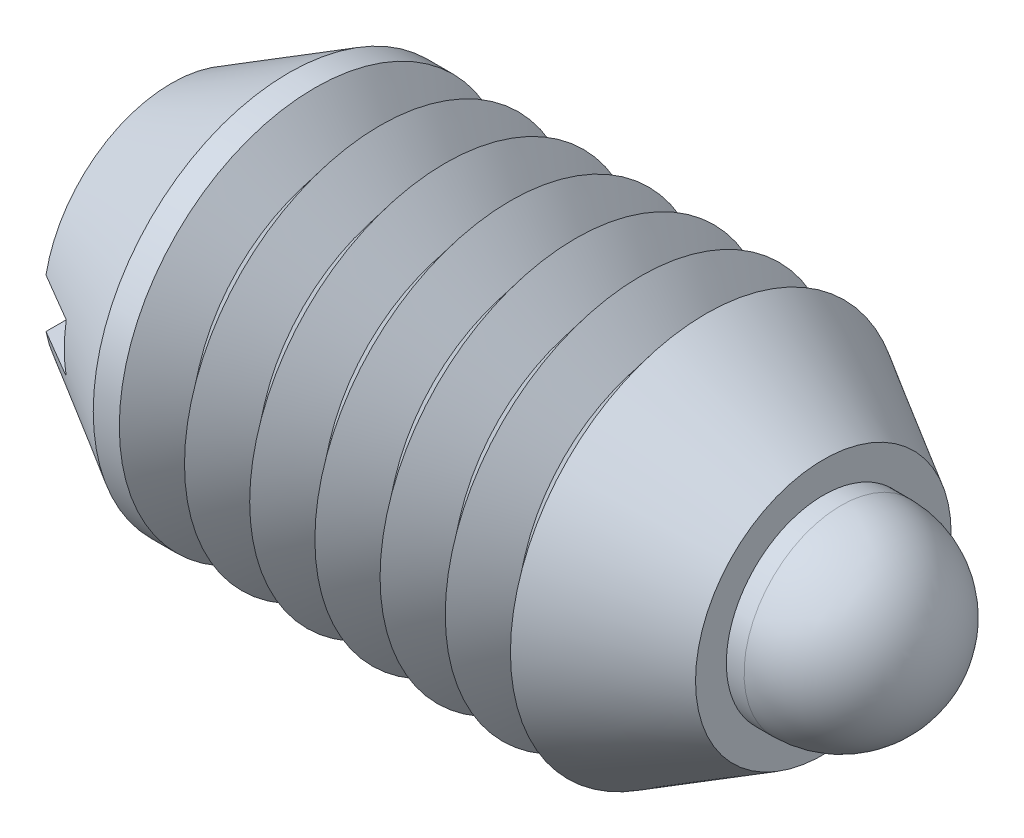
ISO-10303-21;
HEADER;
FILE_DESCRIPTION(('STEP AP214'),'2;1');
FILE_NAME('part.step','',(''),(''),'','','');
FILE_SCHEMA(('AUTOMOTIVE_DESIGN { 1 0 10303 214 1 1 1 1 }'));
ENDSEC;
DATA;
#1=APPLICATION_CONTEXT('core data for automotive mechanical design processes');
#2=APPLICATION_PROTOCOL_DEFINITION('international standard','automotive_design',2000,#1);
#3=PRODUCT_CONTEXT('',#1,'mechanical');
#4=PRODUCT('Part','Part','',(#3));
#5=PRODUCT_RELATED_PRODUCT_CATEGORY('part','',(#4));
#6=PRODUCT_DEFINITION_FORMATION('','',#4);
#7=PRODUCT_DEFINITION_CONTEXT('part definition',#1,'design');
#8=PRODUCT_DEFINITION('design','',#6,#7);
#9=PRODUCT_DEFINITION_SHAPE('','',#8);
#10=(LENGTH_UNIT() NAMED_UNIT(*) SI_UNIT(.MILLI.,.METRE.));
#11=(NAMED_UNIT(*) PLANE_ANGLE_UNIT() SI_UNIT($,.RADIAN.));
#12=(NAMED_UNIT(*) SI_UNIT($,.STERADIAN.) SOLID_ANGLE_UNIT());
#13=UNCERTAINTY_MEASURE_WITH_UNIT(LENGTH_MEASURE(1.E-05),#10,'distance_accuracy_value','');
#14=(GEOMETRIC_REPRESENTATION_CONTEXT(3) GLOBAL_UNCERTAINTY_ASSIGNED_CONTEXT((#13)) GLOBAL_UNIT_ASSIGNED_CONTEXT((#10,
#11,#12)) REPRESENTATION_CONTEXT('',''));
#15=CARTESIAN_POINT('',(0.,0.,0.));
#16=DIRECTION('',(0.,0.,1.));
#17=DIRECTION('',(1.,0.,0.));
#18=AXIS2_PLACEMENT_3D('',#15,#16,#17);
#19=CARTESIAN_POINT('',(10.44194,0.,0.));
#20=DIRECTION('',(-1.,0.,0.));
#21=DIRECTION('',(0.,-0.719424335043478,-0.694570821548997));
#22=AXIS2_PLACEMENT_3D('',#19,#20,#21);
#23=PLANE('',#22);
#24=CARTESIAN_POINT('',(10.44194,0.,0.));
#25=DIRECTION('',(1.,0.,0.));
#26=DIRECTION('',(0.,0.719424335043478,0.694570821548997));
#27=AXIS2_PLACEMENT_3D('',#24,#25,#26);
#28=CIRCLE('',#27,2.3622);
#29=CARTESIAN_POINT('',(10.44194,1.6994241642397,1.64071519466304));
#30=VERTEX_POINT('',#29);
#31=EDGE_CURVE('P0_E10',#30,#30,#28,.T.);
#32=ORIENTED_EDGE('',*,*,#31,.F.);
#33=EDGE_LOOP('',(#32));
#34=FACE_BOUND('',#33,.T.);
#35=ADVANCED_FACE('P0_F14',(#34),#23,.T.);
#36=CARTESIAN_POINT('',(10.91438,0.,0.));
#37=DIRECTION('',(1.,0.,0.));
#38=DIRECTION('',(0.,0.719424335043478,0.694570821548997));
#39=AXIS2_PLACEMENT_3D('',#36,#37,#38);
#40=CONICAL_SURFACE('',#39,2.83464,0.785398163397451);
#41=ORIENTED_EDGE('',*,*,#31,.T.);
#42=EDGE_LOOP('',(#41));
#43=FACE_BOUND('',#42,.T.);
#44=CARTESIAN_POINT('',(10.91438,0.,0.));
#45=DIRECTION('',(1.,0.,0.));
#46=DIRECTION('',(0.,0.719424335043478,0.694570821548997));
#47=AXIS2_PLACEMENT_3D('',#44,#45,#46);
#48=CIRCLE('',#47,2.83464);
#49=CARTESIAN_POINT('',(10.91438,2.03930899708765,1.96885823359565));
#50=VERTEX_POINT('',#49);
#51=EDGE_CURVE('P0_E20',#50,#50,#48,.T.);
#52=ORIENTED_EDGE('',*,*,#51,.F.);
#53=EDGE_LOOP('',(#52));
#54=FACE_BOUND('',#53,.T.);
#55=ADVANCED_FACE('P0_F54',(#43,#54),#40,.T.);
#56=CARTESIAN_POINT('',(18.669,0.,0.));
#57=DIRECTION('',(1.,0.,0.));
#58=DIRECTION('',(0.,0.719424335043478,0.694570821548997));
#59=AXIS2_PLACEMENT_3D('',#56,#57,#58);
#60=CYLINDRICAL_SURFACE('',#59,2.83464);
#61=ORIENTED_EDGE('',*,*,#51,.T.);
#62=EDGE_LOOP('',(#61));
#63=FACE_BOUND('',#62,.T.);
#64=CARTESIAN_POINT('',(14.3480499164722,0.,0.));
#65=DIRECTION('',(1.,0.,0.));
#66=DIRECTION('',(0.,0.719424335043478,0.694570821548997));
#67=AXIS2_PLACEMENT_3D('',#64,#65,#66);
#68=CIRCLE('',#67,2.83464);
#69=CARTESIAN_POINT('',(14.3480499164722,2.03930899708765,1.96885823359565));
#70=VERTEX_POINT('',#69);
#71=EDGE_CURVE('P0_E24',#70,#70,#68,.T.);
#72=ORIENTED_EDGE('',*,*,#71,.F.);
#73=EDGE_LOOP('',(#72));
#74=FACE_BOUND('',#73,.T.);
#75=ADVANCED_FACE('P0_F50',(#63,#74),#60,.T.);
#76=CARTESIAN_POINT('',(15.16634,0.,0.));
#77=DIRECTION('',(-1.,0.,0.));
#78=DIRECTION('',(0.,-0.719424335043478,-0.694570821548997));
#79=AXIS2_PLACEMENT_3D('',#76,#77,#78);
#80=CONICAL_SURFACE('',#79,2.3622,0.5235987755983);
#81=ORIENTED_EDGE('',*,*,#71,.T.);
#82=EDGE_LOOP('',(#81));
#83=FACE_BOUND('',#82,.T.);
#84=CARTESIAN_POINT('',(15.16634,0.,0.));
#85=DIRECTION('',(1.,0.,0.));
#86=DIRECTION('',(0.,0.719424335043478,0.694570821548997));
#87=AXIS2_PLACEMENT_3D('',#84,#85,#86);
#88=CIRCLE('',#87,2.3622);
#89=CARTESIAN_POINT('',(15.16634,1.6994241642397,1.64071519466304));
#90=VERTEX_POINT('',#89);
#91=EDGE_CURVE('P0_E28',#90,#90,#88,.T.);
#92=ORIENTED_EDGE('',*,*,#91,.F.);
#93=EDGE_LOOP('',(#92));
#94=FACE_BOUND('',#93,.T.);
#95=ADVANCED_FACE('P0_F41',(#83,#94),#80,.T.);
#96=CARTESIAN_POINT('',(18.669,0.,0.));
#97=DIRECTION('',(1.,0.,0.));
#98=DIRECTION('',(0.,0.719424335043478,0.694570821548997));
#99=AXIS2_PLACEMENT_3D('',#96,#97,#98);
#100=CYLINDRICAL_SURFACE('',#99,2.3622);
#101=ORIENTED_EDGE('',*,*,#91,.T.);
#102=EDGE_LOOP('',(#101));
#103=FACE_BOUND('',#102,.T.);
#104=CARTESIAN_POINT('',(16.3068,0.,0.));
#105=DIRECTION('',(1.,0.,0.));
#106=DIRECTION('',(0.,0.719424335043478,0.694570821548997));
#107=AXIS2_PLACEMENT_3D('',#104,#105,#106);
#108=CIRCLE('',#107,2.3622);
#109=CARTESIAN_POINT('',(16.3068,1.6994241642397,1.64071519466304));
#110=VERTEX_POINT('',#109);
#111=EDGE_CURVE('P0_E33',#110,#110,#108,.T.);
#112=ORIENTED_EDGE('',*,*,#111,.F.);
#113=EDGE_LOOP('',(#112));
#114=FACE_BOUND('',#113,.T.);
#115=ADVANCED_FACE('P0_F39',(#103,#114),#100,.T.);
#116=CARTESIAN_POINT('',(16.3068,0.,0.));
#117=DIRECTION('',(1.,0.,0.));
#118=DIRECTION('',(0.,0.719424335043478,0.694570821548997));
#119=AXIS2_PLACEMENT_3D('',#116,#117,#118);
#120=SPHERICAL_SURFACE('',#119,2.3622);
#121=ORIENTED_EDGE('',*,*,#111,.T.);
#122=EDGE_LOOP('',(#121));
#123=FACE_BOUND('',#122,.T.);
#124=ADVANCED_FACE('P0_F37',(#123),#120,.T.);
#125=CLOSED_SHELL('',(#35,#55,#75,#95,#115,#124));
#126=MANIFOLD_SOLID_BREP('P0_B1',#125);
#127=CARTESIAN_POINT('',(15.875,0.,0.));
#128=DIRECTION('',(1.,0.,0.));
#129=DIRECTION('',(0.,0.,-1.));
#130=AXIS2_PLACEMENT_3D('',#127,#128,#129);
#131=PLANE('',#130);
#132=CARTESIAN_POINT('',(15.875,0.,0.));
#133=DIRECTION('',(1.,0.,0.));
#134=DIRECTION('',(0.,0.,-1.));
#135=AXIS2_PLACEMENT_3D('',#132,#133,#134);
#136=CIRCLE('',#135,3.11272160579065);
#137=CARTESIAN_POINT('',(15.875,0.,-3.11272160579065));
#138=VERTEX_POINT('',#137);
#139=EDGE_CURVE('P1_E81',#138,#138,#136,.T.);
#140=ORIENTED_EDGE('',*,*,#139,.T.);
#141=EDGE_LOOP('',(#140));
#142=FACE_BOUND('',#141,.T.);
#143=CARTESIAN_POINT('',(15.875,0.,0.));
#144=DIRECTION('',(-1.,0.,0.));
#145=DIRECTION('',(0.,0.,1.));
#146=AXIS2_PLACEMENT_3D('',#143,#144,#145);
#147=CIRCLE('',#146,2.3622);
#148=CARTESIAN_POINT('',(15.875,0.,2.3622));
#149=VERTEX_POINT('',#148);
#150=EDGE_CURVE('P1_E68',#149,#149,#147,.T.);
#151=ORIENTED_EDGE('',*,*,#150,.T.);
#152=EDGE_LOOP('',(#151));
#153=FACE_BOUND('',#152,.T.);
#154=ADVANCED_FACE('P1_F15',(#142,#153),#131,.T.);
#155=CARTESIAN_POINT('',(15.875,0.,0.));
#156=DIRECTION('',(-1.,0.,0.));
#157=DIRECTION('',(0.,0.,1.));
#158=AXIS2_PLACEMENT_3D('',#155,#156,#157);
#159=CONICAL_SURFACE('',#158,3.11272160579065,0.523598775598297);
#160=CARTESIAN_POINT('',(13.0175,0.,0.));
#161=DIRECTION('',(-1.,0.,0.));
#162=DIRECTION('',(0.,0.,1.));
#163=AXIS2_PLACEMENT_3D('',#160,#161,#162);
#164=CIRCLE('',#163,4.7625);
#165=CARTESIAN_POINT('',(13.0175,0.,4.7625));
#166=VERTEX_POINT('',#165);
#167=EDGE_CURVE('P1_E157',#166,#166,#164,.T.);
#168=ORIENTED_EDGE('',*,*,#167,.F.);
#169=EDGE_LOOP('',(#168));
#170=FACE_BOUND('',#169,.T.);
#171=ORIENTED_EDGE('',*,*,#139,.F.);
#172=EDGE_LOOP('',(#171));
#173=FACE_BOUND('',#172,.T.);
#174=ADVANCED_FACE('P1_F17',(#170,#173),#159,.T.);
#175=CARTESIAN_POINT('',(0.,0.,0.));
#176=DIRECTION('',(-1.,0.,0.));
#177=DIRECTION('',(0.,0.,1.));
#178=AXIS2_PLACEMENT_3D('',#175,#176,#177);
#179=CYLINDRICAL_SURFACE('',#178,2.3622);
#180=CARTESIAN_POINT('',(15.16634,0.,0.));
#181=DIRECTION('',(-1.,0.,0.));
#182=DIRECTION('',(0.,0.,1.));
#183=AXIS2_PLACEMENT_3D('',#180,#181,#182);
#184=CIRCLE('',#183,2.3622);
#185=CARTESIAN_POINT('',(15.16634,0.,2.3622));
#186=VERTEX_POINT('',#185);
#187=EDGE_CURVE('P1_E169',#186,#186,#184,.T.);
#188=ORIENTED_EDGE('',*,*,#187,.T.);
#189=EDGE_LOOP('',(#188));
#190=FACE_BOUND('',#189,.T.);
#191=ORIENTED_EDGE('',*,*,#150,.F.);
#192=EDGE_LOOP('',(#191));
#193=FACE_BOUND('',#192,.T.);
#194=ADVANCED_FACE('P1_F374',(#190,#193),#179,.F.);
#195=CARTESIAN_POINT('',(15.16634,0.,0.));
#196=DIRECTION('',(-1.,0.,0.));
#197=DIRECTION('',(0.,0.,1.));
#198=AXIS2_PLACEMENT_3D('',#195,#196,#197);
#199=CONICAL_SURFACE('',#198,2.3622,0.785398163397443);
#200=CARTESIAN_POINT('',(14.6939,0.,0.));
#201=DIRECTION('',(-1.,0.,0.));
#202=DIRECTION('',(0.,0.,1.));
#203=AXIS2_PLACEMENT_3D('',#200,#201,#202);
#204=CIRCLE('',#203,2.83464);
#205=CARTESIAN_POINT('',(14.6939,0.,2.83464));
#206=VERTEX_POINT('',#205);
#207=EDGE_CURVE('P1_E166',#206,#206,#204,.T.);
#208=ORIENTED_EDGE('',*,*,#207,.T.);
#209=EDGE_LOOP('',(#208));
#210=FACE_BOUND('',#209,.T.);
#211=ORIENTED_EDGE('',*,*,#187,.F.);
#212=EDGE_LOOP('',(#211));
#213=FACE_BOUND('',#212,.T.);
#214=ADVANCED_FACE('P1_F364',(#210,#213),#199,.F.);
#215=CARTESIAN_POINT('',(0.,0.,0.));
#216=DIRECTION('',(-1.,0.,0.));
#217=DIRECTION('',(0.,0.,1.));
#218=AXIS2_PLACEMENT_3D('',#215,#216,#217);
#219=CYLINDRICAL_SURFACE('',#218,2.83464);
#220=CARTESIAN_POINT('',(3.571875,0.,0.));
#221=DIRECTION('',(-1.,0.,0.));
#222=DIRECTION('',(0.,0.,1.));
#223=AXIS2_PLACEMENT_3D('',#220,#221,#222);
#224=CIRCLE('',#223,2.83464);
#225=CARTESIAN_POINT('',(3.571875,0.,2.83464));
#226=VERTEX_POINT('',#225);
#227=EDGE_CURVE('P1_E163',#226,#226,#224,.T.);
#228=ORIENTED_EDGE('',*,*,#227,.T.);
#229=EDGE_LOOP('',(#228));
#230=FACE_BOUND('',#229,.T.);
#231=ORIENTED_EDGE('',*,*,#207,.F.);
#232=EDGE_LOOP('',(#231));
#233=FACE_BOUND('',#232,.T.);
#234=ADVANCED_FACE('P1_F354',(#230,#233),#219,.F.);
#235=CARTESIAN_POINT('',(3.571875,0.,0.));
#236=DIRECTION('',(1.,0.,0.));
#237=DIRECTION('',(0.,0.,-1.));
#238=AXIS2_PLACEMENT_3D('',#235,#236,#237);
#239=PLANE('',#238);
#240=ORIENTED_EDGE('',*,*,#227,.F.);
#241=EDGE_LOOP('',(#240));
#242=FACE_BOUND('',#241,.T.);
#243=ADVANCED_FACE('P1_F344',(#242),#239,.T.);
#244=CARTESIAN_POINT('',(12.22375,0.,0.));
#245=DIRECTION('',(1.,0.,0.));
#246=DIRECTION('',(0.,0.,-1.));
#247=AXIS2_PLACEMENT_3D('',#244,#245,#246);
#248=CONICAL_SURFACE('',#247,3.77110656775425,0.895664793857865);
#249=ORIENTED_EDGE('',*,*,#167,.T.);
#250=EDGE_LOOP('',(#249));
#251=FACE_BOUND('',#250,.T.);
#252=CARTESIAN_POINT('',(12.22375,0.,0.));
#253=DIRECTION('',(-1.,0.,0.));
#254=DIRECTION('',(0.,0.,1.));
#255=AXIS2_PLACEMENT_3D('',#252,#253,#254);
#256=CIRCLE('',#255,3.77110656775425);
#257=CARTESIAN_POINT('',(12.22375,0.,3.77110656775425));
#258=VERTEX_POINT('',#257);
#259=EDGE_CURVE('P1_E160',#258,#258,#256,.T.);
#260=ORIENTED_EDGE('',*,*,#259,.F.);
#261=EDGE_LOOP('',(#260));
#262=FACE_BOUND('',#261,.T.);
#263=ADVANCED_FACE('P1_F334',(#251,#262),#248,.T.);
#264=CARTESIAN_POINT('',(11.43,0.,0.));
#265=DIRECTION('',(-1.,0.,0.));
#266=DIRECTION('',(0.,0.,1.));
#267=AXIS2_PLACEMENT_3D('',#264,#265,#266);
#268=CONICAL_SURFACE('',#267,4.7625,0.895664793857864);
#269=ORIENTED_EDGE('',*,*,#259,.T.);
#270=EDGE_LOOP('',(#269));
#271=FACE_BOUND('',#270,.T.);
#272=CARTESIAN_POINT('',(11.43,0.,0.));
#273=DIRECTION('',(-1.,0.,0.));
#274=DIRECTION('',(0.,0.,1.));
#275=AXIS2_PLACEMENT_3D('',#272,#273,#274);
#276=CIRCLE('',#275,4.7625);
#277=CARTESIAN_POINT('',(11.43,0.,4.7625));
#278=VERTEX_POINT('',#277);
#279=EDGE_CURVE('P1_E151',#278,#278,#276,.T.);
#280=ORIENTED_EDGE('',*,*,#279,.F.);
#281=EDGE_LOOP('',(#280));
#282=FACE_BOUND('',#281,.T.);
#283=ADVANCED_FACE('P1_F324',(#271,#282),#268,.T.);
#284=CARTESIAN_POINT('',(10.63625,0.,0.));
#285=DIRECTION('',(1.,0.,0.));
#286=DIRECTION('',(0.,0.,-1.));
#287=AXIS2_PLACEMENT_3D('',#284,#285,#286);
#288=CONICAL_SURFACE('',#287,3.77110656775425,0.895664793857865);
#289=ORIENTED_EDGE('',*,*,#279,.T.);
#290=EDGE_LOOP('',(#289));
#291=FACE_BOUND('',#290,.T.);
#292=CARTESIAN_POINT('',(10.63625,0.,0.));
#293=DIRECTION('',(-1.,0.,0.));
#294=DIRECTION('',(0.,0.,1.));
#295=AXIS2_PLACEMENT_3D('',#292,#293,#294);
#296=CIRCLE('',#295,3.77110656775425);
#297=CARTESIAN_POINT('',(10.63625,0.,3.77110656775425));
#298=VERTEX_POINT('',#297);
#299=EDGE_CURVE('P1_E154',#298,#298,#296,.T.);
#300=ORIENTED_EDGE('',*,*,#299,.F.);
#301=EDGE_LOOP('',(#300));
#302=FACE_BOUND('',#301,.T.);
#303=ADVANCED_FACE('P1_F314',(#291,#302),#288,.T.);
#304=CARTESIAN_POINT('',(9.84249999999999,0.,0.));
#305=DIRECTION('',(-1.,0.,0.));
#306=DIRECTION('',(0.,0.,1.));
#307=AXIS2_PLACEMENT_3D('',#304,#305,#306);
#308=CONICAL_SURFACE('',#307,4.7625,0.895664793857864);
#309=ORIENTED_EDGE('',*,*,#299,.T.);
#310=EDGE_LOOP('',(#309));
#311=FACE_BOUND('',#310,.T.);
#312=CARTESIAN_POINT('',(9.84249999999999,0.,0.));
#313=DIRECTION('',(-1.,0.,0.));
#314=DIRECTION('',(0.,0.,1.));
#315=AXIS2_PLACEMENT_3D('',#312,#313,#314);
#316=CIRCLE('',#315,4.7625);
#317=CARTESIAN_POINT('',(9.84249999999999,0.,4.7625));
#318=VERTEX_POINT('',#317);
#319=EDGE_CURVE('P1_E145',#318,#318,#316,.T.);
#320=ORIENTED_EDGE('',*,*,#319,.F.);
#321=EDGE_LOOP('',(#320));
#322=FACE_BOUND('',#321,.T.);
#323=ADVANCED_FACE('P1_F304',(#311,#322),#308,.T.);
#324=CARTESIAN_POINT('',(9.04874999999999,0.,0.));
#325=DIRECTION('',(1.,0.,0.));
#326=DIRECTION('',(0.,0.,-1.));
#327=AXIS2_PLACEMENT_3D('',#324,#325,#326);
#328=CONICAL_SURFACE('',#327,3.77110656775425,0.895664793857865);
#329=ORIENTED_EDGE('',*,*,#319,.T.);
#330=EDGE_LOOP('',(#329));
#331=FACE_BOUND('',#330,.T.);
#332=CARTESIAN_POINT('',(9.04874999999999,0.,0.));
#333=DIRECTION('',(-1.,0.,0.));
#334=DIRECTION('',(0.,0.,1.));
#335=AXIS2_PLACEMENT_3D('',#332,#333,#334);
#336=CIRCLE('',#335,3.77110656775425);
#337=CARTESIAN_POINT('',(9.04874999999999,0.,3.77110656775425));
#338=VERTEX_POINT('',#337);
#339=EDGE_CURVE('P1_E148',#338,#338,#336,.T.);
#340=ORIENTED_EDGE('',*,*,#339,.F.);
#341=EDGE_LOOP('',(#340));
#342=FACE_BOUND('',#341,.T.);
#343=ADVANCED_FACE('P1_F294',(#331,#342),#328,.T.);
#344=CARTESIAN_POINT('',(8.25499999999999,0.,0.));
#345=DIRECTION('',(-1.,0.,0.));
#346=DIRECTION('',(0.,0.,1.));
#347=AXIS2_PLACEMENT_3D('',#344,#345,#346);
#348=CONICAL_SURFACE('',#347,4.7625,0.895664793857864);
#349=ORIENTED_EDGE('',*,*,#339,.T.);
#350=EDGE_LOOP('',(#349));
#351=FACE_BOUND('',#350,.T.);
#352=CARTESIAN_POINT('',(8.25499999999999,0.,0.));
#353=DIRECTION('',(-1.,0.,0.));
#354=DIRECTION('',(0.,0.,1.));
#355=AXIS2_PLACEMENT_3D('',#352,#353,#354);
#356=CIRCLE('',#355,4.7625);
#357=CARTESIAN_POINT('',(8.25499999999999,0.,4.7625));
#358=VERTEX_POINT('',#357);
#359=EDGE_CURVE('P1_E139',#358,#358,#356,.T.);
#360=ORIENTED_EDGE('',*,*,#359,.F.);
#361=EDGE_LOOP('',(#360));
#362=FACE_BOUND('',#361,.T.);
#363=ADVANCED_FACE('P1_F284',(#351,#362),#348,.T.);
#364=CARTESIAN_POINT('',(7.46124999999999,0.,0.));
#365=DIRECTION('',(1.,0.,0.));
#366=DIRECTION('',(0.,0.,-1.));
#367=AXIS2_PLACEMENT_3D('',#364,#365,#366);
#368=CONICAL_SURFACE('',#367,3.77110656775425,0.895664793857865);
#369=ORIENTED_EDGE('',*,*,#359,.T.);
#370=EDGE_LOOP('',(#369));
#371=FACE_BOUND('',#370,.T.);
#372=CARTESIAN_POINT('',(7.46124999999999,0.,0.));
#373=DIRECTION('',(-1.,0.,0.));
#374=DIRECTION('',(0.,0.,1.));
#375=AXIS2_PLACEMENT_3D('',#372,#373,#374);
#376=CIRCLE('',#375,3.77110656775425);
#377=CARTESIAN_POINT('',(7.46124999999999,0.,3.77110656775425));
#378=VERTEX_POINT('',#377);
#379=EDGE_CURVE('P1_E142',#378,#378,#376,.T.);
#380=ORIENTED_EDGE('',*,*,#379,.F.);
#381=EDGE_LOOP('',(#380));
#382=FACE_BOUND('',#381,.T.);
#383=ADVANCED_FACE('P1_F274',(#371,#382),#368,.T.);
#384=CARTESIAN_POINT('',(6.66749999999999,0.,0.));
#385=DIRECTION('',(-1.,0.,0.));
#386=DIRECTION('',(0.,0.,1.));
#387=AXIS2_PLACEMENT_3D('',#384,#385,#386);
#388=CONICAL_SURFACE('',#387,4.7625,0.895664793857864);
#389=ORIENTED_EDGE('',*,*,#379,.T.);
#390=EDGE_LOOP('',(#389));
#391=FACE_BOUND('',#390,.T.);
#392=CARTESIAN_POINT('',(6.66749999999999,0.,0.));
#393=DIRECTION('',(-1.,0.,0.));
#394=DIRECTION('',(0.,0.,1.));
#395=AXIS2_PLACEMENT_3D('',#392,#393,#394);
#396=CIRCLE('',#395,4.7625);
#397=CARTESIAN_POINT('',(6.66749999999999,0.,4.7625));
#398=VERTEX_POINT('',#397);
#399=EDGE_CURVE('P1_E129',#398,#398,#396,.T.);
#400=ORIENTED_EDGE('',*,*,#399,.F.);
#401=EDGE_LOOP('',(#400));
#402=FACE_BOUND('',#401,.T.);
#403=ADVANCED_FACE('P1_F264',(#391,#402),#388,.T.);
#404=CARTESIAN_POINT('',(5.87374999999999,0.,0.));
#405=DIRECTION('',(1.,0.,0.));
#406=DIRECTION('',(0.,0.,-1.));
#407=AXIS2_PLACEMENT_3D('',#404,#405,#406);
#408=CONICAL_SURFACE('',#407,3.77110656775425,0.895664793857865);
#409=ORIENTED_EDGE('',*,*,#399,.T.);
#410=EDGE_LOOP('',(#409));
#411=FACE_BOUND('',#410,.T.);
#412=CARTESIAN_POINT('',(5.87374999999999,0.,0.));
#413=DIRECTION('',(-1.,0.,0.));
#414=DIRECTION('',(0.,0.,1.));
#415=AXIS2_PLACEMENT_3D('',#412,#413,#414);
#416=CIRCLE('',#415,3.77110656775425);
#417=CARTESIAN_POINT('',(5.87374999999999,0.,3.77110656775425));
#418=VERTEX_POINT('',#417);
#419=EDGE_CURVE('P1_E136',#418,#418,#416,.T.);
#420=ORIENTED_EDGE('',*,*,#419,.F.);
#421=EDGE_LOOP('',(#420));
#422=FACE_BOUND('',#421,.T.);
#423=ADVANCED_FACE('P1_F254',(#411,#422),#408,.T.);
#424=CARTESIAN_POINT('',(5.07999999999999,0.,0.));
#425=DIRECTION('',(-1.,0.,0.));
#426=DIRECTION('',(0.,0.,1.));
#427=AXIS2_PLACEMENT_3D('',#424,#425,#426);
#428=CONICAL_SURFACE('',#427,4.7625,0.895664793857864);
#429=ORIENTED_EDGE('',*,*,#419,.T.);
#430=EDGE_LOOP('',(#429));
#431=FACE_BOUND('',#430,.T.);
#432=CARTESIAN_POINT('',(5.07999999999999,0.,0.));
#433=DIRECTION('',(-1.,0.,0.));
#434=DIRECTION('',(0.,0.,1.));
#435=AXIS2_PLACEMENT_3D('',#432,#433,#434);
#436=CIRCLE('',#435,4.7625);
#437=CARTESIAN_POINT('',(5.07999999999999,0.,4.7625));
#438=VERTEX_POINT('',#437);
#439=EDGE_CURVE('P1_E126',#438,#438,#436,.T.);
#440=ORIENTED_EDGE('',*,*,#439,.F.);
#441=EDGE_LOOP('',(#440));
#442=FACE_BOUND('',#441,.T.);
#443=ADVANCED_FACE('P1_F244',(#431,#442),#428,.T.);
#444=CARTESIAN_POINT('',(4.28624999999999,0.,0.));
#445=DIRECTION('',(1.,0.,0.));
#446=DIRECTION('',(0.,0.,-1.));
#447=AXIS2_PLACEMENT_3D('',#444,#445,#446);
#448=CONICAL_SURFACE('',#447,3.77110656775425,0.895664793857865);
#449=ORIENTED_EDGE('',*,*,#439,.T.);
#450=EDGE_LOOP('',(#449));
#451=FACE_BOUND('',#450,.T.);
#452=CARTESIAN_POINT('',(4.28624999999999,0.,0.));
#453=DIRECTION('',(-1.,0.,0.));
#454=DIRECTION('',(0.,0.,1.));
#455=AXIS2_PLACEMENT_3D('',#452,#453,#454);
#456=CIRCLE('',#455,3.77110656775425);
#457=CARTESIAN_POINT('',(4.28624999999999,0.,3.77110656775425));
#458=VERTEX_POINT('',#457);
#459=EDGE_CURVE('P1_E125',#458,#458,#456,.T.);
#460=ORIENTED_EDGE('',*,*,#459,.F.);
#461=EDGE_LOOP('',(#460));
#462=FACE_BOUND('',#461,.T.);
#463=ADVANCED_FACE('P1_F234',(#451,#462),#448,.T.);
#464=CARTESIAN_POINT('',(3.49249999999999,0.,0.));
#465=DIRECTION('',(-1.,0.,0.));
#466=DIRECTION('',(0.,0.,1.));
#467=AXIS2_PLACEMENT_3D('',#464,#465,#466);
#468=CONICAL_SURFACE('',#467,4.7625,0.895664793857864);
#469=ORIENTED_EDGE('',*,*,#459,.T.);
#470=EDGE_LOOP('',(#469));
#471=FACE_BOUND('',#470,.T.);
#472=CARTESIAN_POINT('',(3.49249999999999,0.,0.));
#473=DIRECTION('',(-1.,0.,0.));
#474=DIRECTION('',(0.,0.,1.));
#475=AXIS2_PLACEMENT_3D('',#472,#473,#474);
#476=CIRCLE('',#475,4.7625);
#477=CARTESIAN_POINT('',(3.49249999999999,0.,4.7625));
#478=VERTEX_POINT('',#477);
#479=EDGE_CURVE('P1_E123',#478,#478,#476,.T.);
#480=ORIENTED_EDGE('',*,*,#479,.F.);
#481=EDGE_LOOP('',(#480));
#482=FACE_BOUND('',#481,.T.);
#483=ADVANCED_FACE('P1_F110',(#471,#482),#468,.T.);
#484=CARTESIAN_POINT('',(0.,0.,0.));
#485=DIRECTION('',(1.,0.,0.));
#486=DIRECTION('',(0.,0.,-1.));
#487=AXIS2_PLACEMENT_3D('',#484,#485,#486);
#488=PLANE('',#487);
#489=CARTESIAN_POINT('',(0.,0.,0.));
#490=DIRECTION('',(1.,0.,0.));
#491=DIRECTION('',(0.,0.,-1.));
#492=AXIS2_PLACEMENT_3D('',#489,#490,#491);
#493=CIRCLE('',#492,3.11272160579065);
#494=CARTESIAN_POINT('',(0.,-0.5953125,-3.05526411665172));
#495=VERTEX_POINT('',#494);
#496=CARTESIAN_POINT('',(0.,-0.5953125,3.05526411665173));
#497=VERTEX_POINT('',#496);
#498=EDGE_CURVE('P1_E77',#495,#497,#493,.F.);
#499=ORIENTED_EDGE('',*,*,#498,.T.);
#500=DIRECTION('',(0.,0.,1.));
#501=VECTOR('',#500,1.);
#502=CARTESIAN_POINT('',(0.,-0.5953125,-4.7625));
#503=LINE('',#502,#501);
#504=EDGE_CURVE('P1_E35',#495,#497,#503,.T.);
#505=ORIENTED_EDGE('',*,*,#504,.F.);
#506=EDGE_LOOP('',(#499,#505));
#507=FACE_BOUND('',#506,.T.);
#508=ADVANCED_FACE('P1_F101',(#507),#488,.F.);
#509=CARTESIAN_POINT('',(0.,-0.5953125,-4.7625));
#510=DIRECTION('',(0.,-1.,0.));
#511=DIRECTION('',(0.,0.,-1.));
#512=AXIS2_PLACEMENT_3D('',#509,#510,#511);
#513=PLANE('',#512);
#514=CARTESIAN_POINT('',(6.95030037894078,-0.5953125,-7.1005675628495));
#515=CARTESIAN_POINT('',(6.6032863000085,-0.5953125,-6.89951311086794));
#516=CARTESIAN_POINT('',(6.25629570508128,-0.5953125,-6.69841809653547));
#517=CARTESIAN_POINT('',(5.56238222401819,-0.5953125,-6.29611043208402));
#518=CARTESIAN_POINT('',(5.21545933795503,-0.5953125,-6.09489778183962));
#519=CARTESIAN_POINT('',(4.52163449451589,-0.5953125,-5.69227915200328));
#520=CARTESIAN_POINT('',(4.1747325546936,-0.5953125,-5.49087314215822));
#521=CARTESIAN_POINT('',(3.48105251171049,-0.5953125,-5.08784863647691));
#522=CARTESIAN_POINT('',(3.13427440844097,-0.5953125,-4.88623014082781));
#523=CARTESIAN_POINT('',(2.44993548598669,-0.5953125,-4.48794937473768));
#524=CARTESIAN_POINT('',(2.11237010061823,-0.5953125,-4.29129495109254));
#525=CARTESIAN_POINT('',(1.43748846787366,-0.5953125,-3.89755677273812));
#526=CARTESIAN_POINT('',(1.10017222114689,-0.5953125,-3.7004730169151));
#527=CARTESIAN_POINT('',(0.425997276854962,-0.5953125,-3.30565694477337));
#528=CARTESIAN_POINT('',(0.0891385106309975,-0.5953125,-3.10792474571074));
#529=CARTESIAN_POINT('',(-0.583902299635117,-0.5953125,-2.71131332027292));
#530=CARTESIAN_POINT('',(-0.920084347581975,-0.5953125,-2.51243410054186));
#531=CARTESIAN_POINT('',(-1.42425686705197,-0.5953125,-2.21184727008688));
#532=CARTESIAN_POINT('',(-1.59275690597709,-0.5953125,-2.11099555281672));
#533=CARTESIAN_POINT('',(-1.92927626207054,-0.5953125,-1.90836335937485));
#534=CARTESIAN_POINT('',(-2.09729539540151,-0.5953125,-1.80658257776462));
#535=CARTESIAN_POINT('',(-2.4342119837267,-0.5953125,-1.60055194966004));
#536=CARTESIAN_POINT('',(-2.6031005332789,-0.5953125,-1.49628745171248));
#537=CARTESIAN_POINT('',(-2.85513070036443,-0.5953125,-1.33799461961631));
#538=CARTESIAN_POINT('',(-2.93888336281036,-0.5953125,-1.28494050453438));
#539=CARTESIAN_POINT('',(-3.10579445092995,-0.5953125,-1.17790920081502));
#540=CARTESIAN_POINT('',(-3.18895290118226,-0.5953125,-1.12393205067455));
#541=CARTESIAN_POINT('',(-3.35444558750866,-0.5953125,-1.01457407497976));
#542=CARTESIAN_POINT('',(-3.43677905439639,-0.5953125,-0.959192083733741));
#543=CARTESIAN_POINT('',(-3.60023936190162,-0.5953125,-0.846169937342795));
#544=CARTESIAN_POINT('',(-3.68136227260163,-0.5953125,-0.788524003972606));
#545=CARTESIAN_POINT('',(-3.80062582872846,-0.5953125,-0.699609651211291));
#546=CARTESIAN_POINT('',(-3.83978898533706,-0.5953125,-0.669717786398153));
#547=CARTESIAN_POINT('',(-3.91713709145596,-0.5953125,-0.608699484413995));
#548=CARTESIAN_POINT('',(-3.95532226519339,-0.5953125,-0.577573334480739));
#549=CARTESIAN_POINT('',(-4.03005513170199,-0.5953125,-0.513713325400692));
#550=CARTESIAN_POINT('',(-4.06660901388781,-0.5953125,-0.480986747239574));
#551=CARTESIAN_POINT('',(-4.1372977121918,-0.5953125,-0.413038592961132));
#552=CARTESIAN_POINT('',(-4.17143639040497,-0.5953125,-0.377821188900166));
#553=CARTESIAN_POINT('',(-4.21484326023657,-0.5953125,-0.327346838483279));
#554=CARTESIAN_POINT('',(-4.22603371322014,-0.5953125,-0.313755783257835));
#555=CARTESIAN_POINT('',(-4.24767015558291,-0.5953125,-0.285990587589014));
#556=CARTESIAN_POINT('',(-4.25811579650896,-0.5953125,-0.271816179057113));
#557=CARTESIAN_POINT('',(-4.28796639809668,-0.5953125,-0.228385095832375));
#558=CARTESIAN_POINT('',(-4.30599084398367,-0.5953125,-0.198103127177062));
#559=CARTESIAN_POINT('',(-4.32992762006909,-0.5953125,-0.146713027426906));
#560=CARTESIAN_POINT('',(-4.33783306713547,-0.5953125,-0.126548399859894));
#561=CARTESIAN_POINT('',(-4.35036452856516,-0.5953125,-0.0852127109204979));
#562=CARTESIAN_POINT('',(-4.3549949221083,-0.5953125,-0.0640430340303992));
#563=CARTESIAN_POINT('',(-4.36031144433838,-0.5953125,-0.0210056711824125));
#564=CARTESIAN_POINT('',(-4.36096337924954,-0.5953125,0.000866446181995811));
#565=CARTESIAN_POINT('',(-4.35811215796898,-0.5953125,0.0443320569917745));
#566=CARTESIAN_POINT('',(-4.3546071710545,-0.5953125,0.0659254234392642));
#567=CARTESIAN_POINT('',(-4.34291129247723,-0.5953125,0.112613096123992));
#568=CARTESIAN_POINT('',(-4.3338924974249,-0.5953125,0.137493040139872));
#569=CARTESIAN_POINT('',(-4.31210728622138,-0.5953125,0.185556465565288));
#570=CARTESIAN_POINT('',(-4.29932953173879,-0.5953125,0.208734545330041));
#571=CARTESIAN_POINT('',(-4.26712767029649,-0.5953125,0.260114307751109));
#572=CARTESIAN_POINT('',(-4.24685576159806,-0.5953125,0.287772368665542));
#573=CARTESIAN_POINT('',(-4.20375799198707,-0.5953125,0.34105036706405));
#574=CARTESIAN_POINT('',(-4.18092653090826,-0.5953125,0.366665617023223));
#575=CARTESIAN_POINT('',(-4.13348485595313,-0.5953125,0.416511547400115));
#576=CARTESIAN_POINT('',(-4.10886344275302,-0.5953125,0.440731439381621));
#577=CARTESIAN_POINT('',(-4.0585489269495,-0.5953125,0.487960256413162));
#578=CARTESIAN_POINT('',(-4.03285704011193,-0.5953125,0.510970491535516));
#579=CARTESIAN_POINT('',(-3.97783091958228,-0.5953125,0.558571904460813));
#580=CARTESIAN_POINT('',(-3.94840684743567,-0.5953125,0.583058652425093));
#581=CARTESIAN_POINT('',(-3.8888766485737,-0.5953125,0.631191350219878));
#582=CARTESIAN_POINT('',(-3.85877042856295,-0.5953125,0.654837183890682));
#583=CARTESIAN_POINT('',(-3.76767869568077,-0.5953125,0.724827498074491));
#584=CARTESIAN_POINT('',(-3.70594879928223,-0.5953125,0.77020074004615));
#585=CARTESIAN_POINT('',(-3.58119958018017,-0.5953125,0.85939064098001));
#586=CARTESIAN_POINT('',(-3.51817788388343,-0.5953125,0.903203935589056));
#587=CARTESIAN_POINT('',(-3.39138262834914,-0.5953125,0.9896859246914));
#588=CARTESIAN_POINT('',(-3.32760929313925,-0.5953125,1.03235494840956));
#589=CARTESIAN_POINT('',(-3.19966809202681,-0.5953125,1.11679778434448));
#590=CARTESIAN_POINT('',(-3.13550134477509,-0.5953125,1.15857329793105));
#591=CARTESIAN_POINT('',(-3.00677965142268,-0.5953125,1.24153113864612));
#592=CARTESIAN_POINT('',(-2.94222467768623,-0.5953125,1.28271342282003));
#593=CARTESIAN_POINT('',(-2.74829322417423,-0.5953125,1.40548817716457));
#594=CARTESIAN_POINT('',(-2.61849325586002,-0.5953125,1.48641098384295));
#595=CARTESIAN_POINT('',(-2.35898192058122,-0.5953125,1.64668368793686));
#596=CARTESIAN_POINT('',(-2.22927451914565,-0.5953125,1.72604003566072));
#597=CARTESIAN_POINT('',(-1.96941282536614,-0.5953125,1.88401833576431));
#598=CARTESIAN_POINT('',(-1.83925853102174,-0.5953125,1.96264028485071));
#599=CARTESIAN_POINT('',(-1.44833283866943,-0.5953125,2.19775500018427));
#600=CARTESIAN_POINT('',(-1.18710709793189,-0.5953125,2.35349145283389));
#601=CARTESIAN_POINT('',(-0.663876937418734,-0.5953125,2.6639543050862));
#602=CARTESIAN_POINT('',(-0.401872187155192,-0.5953125,2.81868014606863));
#603=CARTESIAN_POINT('',(0.122530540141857,-0.5953125,3.12745407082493));
#604=CARTESIAN_POINT('',(0.384928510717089,-0.5953125,3.28150216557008));
#605=CARTESIAN_POINT('',(0.909819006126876,-0.5953125,3.58906313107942));
#606=CARTESIAN_POINT('',(1.17231137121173,-0.5953125,3.7425762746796));
#607=CARTESIAN_POINT('',(1.69747533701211,-0.5953125,4.04929816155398));
#608=CARTESIAN_POINT('',(1.96014693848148,-0.5953125,4.20250690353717));
#609=CARTESIAN_POINT('',(2.74827094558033,-0.5953125,4.66176450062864));
#610=CARTESIAN_POINT('',(3.27391129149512,-0.5953125,4.96749078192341));
#611=CARTESIAN_POINT('',(4.06209764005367,-0.5953125,5.42543726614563));
#612=CARTESIAN_POINT('',(4.32453853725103,-0.5953125,5.57783851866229));
#613=CARTESIAN_POINT('',(4.84948661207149,-0.5953125,5.88254927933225));
#614=CARTESIAN_POINT('',(5.11199379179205,-0.5953125,6.03485878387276));
#615=CARTESIAN_POINT('',(5.63711856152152,-0.5953125,6.33943977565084));
#616=CARTESIAN_POINT('',(5.89973616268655,-0.5953125,6.49171124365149));
#617=CARTESIAN_POINT('',(6.42499790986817,-0.5953125,6.79618582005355));
#618=CARTESIAN_POINT('',(6.68764205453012,-0.5953125,6.94838893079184));
#619=CARTESIAN_POINT('',(6.95030037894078,-0.5953125,7.1005675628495));
#620=B_SPLINE_CURVE_WITH_KNOTS('',3,(#514,#515,#516,#517,#518,#519,#520,#521,#522,#523,#524,
#525,#526,#527,#528,#529,#530,#531,#532,#533,#534,#535,#536,#537,#538,#539,#540,#541,#542,#543,
#544,#545,#546,#547,#548,#549,#550,#551,#552,#553,#554,#555,#556,#557,#558,#559,#560,#561,#562,
#563,#564,#565,#566,#567,#568,#569,#570,#571,#572,#573,#574,#575,#576,#577,#578,#579,#580,#581,
#582,#583,#584,#585,#586,#587,#588,#589,#590,#591,#592,#593,#594,#595,#596,#597,#598,#599,#600,
#601,#602,#603,#604,#605,#606,#607,#608,#609,#610,#611,#612,#613,#614,#615,#616,#617,#618,#619),
.UNSPECIFIED.,.F.,.F.,(4,2,2,2,2,2,2,2,2,2,2,2,2,2,2,2,2,2,2,2,2,2,2,2,2,2,2,2,2,2,2,2,2,2,2,2,
2,2,2,2,2,2,2,2,2,2,2,2,2,2,2,2,4),(0.,1.20315211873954,2.40630552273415,3.60969569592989,
4.81308481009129,5.98509580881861,7.15710985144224,8.32892251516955,9.50072839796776,
10.089852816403,10.6791784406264,11.27460300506,11.572027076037,11.8694387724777,
12.1671058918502,12.4655896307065,12.6133761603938,12.7611284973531,12.9082618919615,
13.0551544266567,13.1079449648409,13.1607600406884,13.2659181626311,13.3306881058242,
13.3953712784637,13.4606096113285,13.5258766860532,13.6048180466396,13.6840000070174,
13.7866183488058,13.889465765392,13.9930237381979,14.0964671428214,14.2112866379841,
14.3261219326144,14.5559047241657,14.7861562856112,15.0163408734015,15.2460389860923,
15.4757536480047,15.9346207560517,16.390790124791,16.846961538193,17.7593341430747,
18.67217438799,19.5849998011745,20.497258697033,21.4095214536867,23.2337733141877,
24.1442195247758,25.054699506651,25.9654088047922,26.8760841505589),.UNSPECIFIED.);
#621=CARTESIAN_POINT('',(1.190625,-0.5953125,-3.75321002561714));
#622=VERTEX_POINT('',#621);
#623=EDGE_CURVE('P1_E93',#622,#495,#620,.T.);
#624=ORIENTED_EDGE('',*,*,#623,.T.);
#625=ORIENTED_EDGE('',*,*,#504,.T.);
#626=CARTESIAN_POINT('',(1.190625,-0.5953125,3.75321002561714));
#627=VERTEX_POINT('',#626);
#628=EDGE_CURVE('P1_E88',#497,#627,#620,.T.);
#629=ORIENTED_EDGE('',*,*,#628,.T.);
#630=DIRECTION('',(0.,0.,1.));
#631=VECTOR('',#630,1.);
#632=CARTESIAN_POINT('',(1.190625,-0.5953125,-4.7625));
#633=LINE('',#632,#631);
#634=EDGE_CURVE('P1_E175',#622,#627,#633,.T.);
#635=ORIENTED_EDGE('',*,*,#634,.F.);
#636=EDGE_LOOP('',(#624,#625,#629,#635));
#637=FACE_BOUND('',#636,.T.);
#638=ADVANCED_FACE('P1_F96',(#637),#513,.F.);
#639=CARTESIAN_POINT('',(1.190625,0.5953125,-4.7625));
#640=DIRECTION('',(1.,0.,0.));
#641=DIRECTION('',(0.,0.,-1.));
#642=AXIS2_PLACEMENT_3D('',#639,#640,#641);
#643=PLANE('',#642);
#644=CARTESIAN_POINT('',(1.190625,0.,0.));
#645=DIRECTION('',(1.,0.,0.));
#646=DIRECTION('',(0.,0.,-1.));
#647=AXIS2_PLACEMENT_3D('',#644,#645,#646);
#648=CIRCLE('',#647,3.80012927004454);
#649=CARTESIAN_POINT('',(1.190625,0.5953125,3.75321002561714));
#650=VERTEX_POINT('',#649);
#651=EDGE_CURVE('P1_E43',#627,#650,#648,.F.);
#652=ORIENTED_EDGE('',*,*,#651,.T.);
#653=DIRECTION('',(0.,0.,1.));
#654=VECTOR('',#653,1.);
#655=CARTESIAN_POINT('',(1.190625,0.5953125,-4.7625));
#656=LINE('',#655,#654);
#657=CARTESIAN_POINT('',(1.190625,0.5953125,-3.75321002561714));
#658=VERTEX_POINT('',#657);
#659=EDGE_CURVE('P1_E83',#658,#650,#656,.T.);
#660=ORIENTED_EDGE('',*,*,#659,.F.);
#661=EDGE_CURVE('P1_E28',#658,#622,#648,.F.);
#662=ORIENTED_EDGE('',*,*,#661,.T.);
#663=ORIENTED_EDGE('',*,*,#634,.T.);
#664=EDGE_LOOP('',(#652,#660,#662,#663));
#665=FACE_BOUND('',#664,.T.);
#666=ADVANCED_FACE('P1_F100',(#665),#643,.F.);
#667=CARTESIAN_POINT('',(0.,0.5953125,3.05526411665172));
#668=VERTEX_POINT('',#667);
#669=CARTESIAN_POINT('',(0.,0.5953125,-3.05526411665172));
#670=VERTEX_POINT('',#669);
#671=EDGE_CURVE('P1_E74',#668,#670,#493,.F.);
#672=ORIENTED_EDGE('',*,*,#671,.T.);
#673=DIRECTION('',(0.,0.,1.));
#674=VECTOR('',#673,1.);
#675=CARTESIAN_POINT('',(0.,0.5953125,-4.7625));
#676=LINE('',#675,#674);
#677=EDGE_CURVE('P1_E61',#670,#668,#676,.T.);
#678=ORIENTED_EDGE('',*,*,#677,.T.);
#679=EDGE_LOOP('',(#672,#678));
#680=FACE_BOUND('',#679,.T.);
#681=ADVANCED_FACE('P1_F76',(#680),#488,.F.);
#682=CARTESIAN_POINT('',(0.,0.5953125,-4.7625));
#683=DIRECTION('',(0.,1.,0.));
#684=DIRECTION('',(0.,0.,1.));
#685=AXIS2_PLACEMENT_3D('',#682,#683,#684);
#686=PLANE('',#685);
#687=CARTESIAN_POINT('',(6.95030037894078,0.5953125,7.1005675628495));
#688=CARTESIAN_POINT('',(6.6032863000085,0.5953125,6.89951311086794));
#689=CARTESIAN_POINT('',(6.25629570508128,0.5953125,6.69841809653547));
#690=CARTESIAN_POINT('',(5.56238222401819,0.5953125,6.29611043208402));
#691=CARTESIAN_POINT('',(5.21545933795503,0.5953125,6.09489778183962));
#692=CARTESIAN_POINT('',(4.52163449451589,0.5953125,5.69227915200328));
#693=CARTESIAN_POINT('',(4.1747325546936,0.5953125,5.49087314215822));
#694=CARTESIAN_POINT('',(3.48105251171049,0.5953125,5.08784863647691));
#695=CARTESIAN_POINT('',(3.13427440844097,0.5953125,4.88623014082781));
#696=CARTESIAN_POINT('',(2.44993548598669,0.5953125,4.48794937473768));
#697=CARTESIAN_POINT('',(2.11237010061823,0.5953125,4.29129495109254));
#698=CARTESIAN_POINT('',(1.43748846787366,0.5953125,3.89755677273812));
#699=CARTESIAN_POINT('',(1.10017222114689,0.5953125,3.7004730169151));
#700=CARTESIAN_POINT('',(0.425997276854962,0.5953125,3.30565694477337));
#701=CARTESIAN_POINT('',(0.0891385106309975,0.5953125,3.10792474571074));
#702=CARTESIAN_POINT('',(-0.583902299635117,0.5953125,2.71131332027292));
#703=CARTESIAN_POINT('',(-0.920084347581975,0.5953125,2.51243410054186));
#704=CARTESIAN_POINT('',(-1.42425686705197,0.5953125,2.21184727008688));
#705=CARTESIAN_POINT('',(-1.59275690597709,0.5953125,2.11099555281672));
#706=CARTESIAN_POINT('',(-1.92927626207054,0.5953125,1.90836335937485));
#707=CARTESIAN_POINT('',(-2.09729539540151,0.5953125,1.80658257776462));
#708=CARTESIAN_POINT('',(-2.4342119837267,0.5953125,1.60055194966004));
#709=CARTESIAN_POINT('',(-2.6031005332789,0.5953125,1.49628745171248));
#710=CARTESIAN_POINT('',(-2.85513070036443,0.5953125,1.33799461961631));
#711=CARTESIAN_POINT('',(-2.93888336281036,0.5953125,1.28494050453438));
#712=CARTESIAN_POINT('',(-3.10579445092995,0.5953125,1.17790920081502));
#713=CARTESIAN_POINT('',(-3.18895290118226,0.5953125,1.12393205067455));
#714=CARTESIAN_POINT('',(-3.35444558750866,0.5953125,1.01457407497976));
#715=CARTESIAN_POINT('',(-3.43677905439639,0.5953125,0.959192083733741));
#716=CARTESIAN_POINT('',(-3.60023936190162,0.5953125,0.846169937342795));
#717=CARTESIAN_POINT('',(-3.68136227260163,0.5953125,0.788524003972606));
#718=CARTESIAN_POINT('',(-3.80062582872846,0.5953125,0.699609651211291));
#719=CARTESIAN_POINT('',(-3.83978898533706,0.5953125,0.669717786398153));
#720=CARTESIAN_POINT('',(-3.91713709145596,0.5953125,0.608699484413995));
#721=CARTESIAN_POINT('',(-3.95532226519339,0.5953125,0.577573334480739));
#722=CARTESIAN_POINT('',(-4.03005513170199,0.5953125,0.513713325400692));
#723=CARTESIAN_POINT('',(-4.06660901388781,0.5953125,0.480986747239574));
#724=CARTESIAN_POINT('',(-4.1372977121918,0.5953125,0.413038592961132));
#725=CARTESIAN_POINT('',(-4.17143639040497,0.5953125,0.377821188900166));
#726=CARTESIAN_POINT('',(-4.21484326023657,0.5953125,0.327346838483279));
#727=CARTESIAN_POINT('',(-4.22603371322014,0.5953125,0.313755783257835));
#728=CARTESIAN_POINT('',(-4.24767015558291,0.5953125,0.285990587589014));
#729=CARTESIAN_POINT('',(-4.25811579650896,0.5953125,0.271816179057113));
#730=CARTESIAN_POINT('',(-4.28796639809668,0.5953125,0.228385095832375));
#731=CARTESIAN_POINT('',(-4.30599084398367,0.5953125,0.198103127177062));
#732=CARTESIAN_POINT('',(-4.32992762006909,0.5953125,0.146713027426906));
#733=CARTESIAN_POINT('',(-4.33783306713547,0.5953125,0.126548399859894));
#734=CARTESIAN_POINT('',(-4.35036452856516,0.5953125,0.0852127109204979));
#735=CARTESIAN_POINT('',(-4.3549949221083,0.5953125,0.0640430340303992));
#736=CARTESIAN_POINT('',(-4.36031144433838,0.5953125,0.0210056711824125));
#737=CARTESIAN_POINT('',(-4.36096337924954,0.5953125,-0.000866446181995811));
#738=CARTESIAN_POINT('',(-4.35811215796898,0.5953125,-0.0443320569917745));
#739=CARTESIAN_POINT('',(-4.3546071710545,0.5953125,-0.0659254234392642));
#740=CARTESIAN_POINT('',(-4.34291129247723,0.5953125,-0.112613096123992));
#741=CARTESIAN_POINT('',(-4.3338924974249,0.5953125,-0.137493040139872));
#742=CARTESIAN_POINT('',(-4.31210728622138,0.5953125,-0.185556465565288));
#743=CARTESIAN_POINT('',(-4.29932953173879,0.5953125,-0.208734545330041));
#744=CARTESIAN_POINT('',(-4.26712767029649,0.5953125,-0.260114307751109));
#745=CARTESIAN_POINT('',(-4.24685576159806,0.5953125,-0.287772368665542));
#746=CARTESIAN_POINT('',(-4.20375799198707,0.5953125,-0.34105036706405));
#747=CARTESIAN_POINT('',(-4.18092653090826,0.5953125,-0.366665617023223));
#748=CARTESIAN_POINT('',(-4.13348485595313,0.5953125,-0.416511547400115));
#749=CARTESIAN_POINT('',(-4.10886344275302,0.5953125,-0.440731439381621));
#750=CARTESIAN_POINT('',(-4.0585489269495,0.5953125,-0.487960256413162));
#751=CARTESIAN_POINT('',(-4.03285704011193,0.5953125,-0.510970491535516));
#752=CARTESIAN_POINT('',(-3.97783091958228,0.5953125,-0.558571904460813));
#753=CARTESIAN_POINT('',(-3.94840684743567,0.5953125,-0.583058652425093));
#754=CARTESIAN_POINT('',(-3.8888766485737,0.5953125,-0.631191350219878));
#755=CARTESIAN_POINT('',(-3.85877042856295,0.5953125,-0.654837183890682));
#756=CARTESIAN_POINT('',(-3.76767869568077,0.5953125,-0.724827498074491));
#757=CARTESIAN_POINT('',(-3.70594879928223,0.5953125,-0.77020074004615));
#758=CARTESIAN_POINT('',(-3.58119958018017,0.5953125,-0.85939064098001));
#759=CARTESIAN_POINT('',(-3.51817788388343,0.5953125,-0.903203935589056));
#760=CARTESIAN_POINT('',(-3.39138262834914,0.5953125,-0.9896859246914));
#761=CARTESIAN_POINT('',(-3.32760929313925,0.5953125,-1.03235494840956));
#762=CARTESIAN_POINT('',(-3.19966809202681,0.5953125,-1.11679778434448));
#763=CARTESIAN_POINT('',(-3.13550134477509,0.5953125,-1.15857329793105));
#764=CARTESIAN_POINT('',(-3.00677965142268,0.5953125,-1.24153113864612));
#765=CARTESIAN_POINT('',(-2.94222467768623,0.5953125,-1.28271342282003));
#766=CARTESIAN_POINT('',(-2.74829322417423,0.5953125,-1.40548817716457));
#767=CARTESIAN_POINT('',(-2.61849325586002,0.5953125,-1.48641098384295));
#768=CARTESIAN_POINT('',(-2.35898192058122,0.5953125,-1.64668368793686));
#769=CARTESIAN_POINT('',(-2.22927451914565,0.5953125,-1.72604003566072));
#770=CARTESIAN_POINT('',(-1.96941282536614,0.5953125,-1.88401833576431));
#771=CARTESIAN_POINT('',(-1.83925853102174,0.5953125,-1.96264028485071));
#772=CARTESIAN_POINT('',(-1.44833283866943,0.5953125,-2.19775500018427));
#773=CARTESIAN_POINT('',(-1.18710709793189,0.5953125,-2.35349145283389));
#774=CARTESIAN_POINT('',(-0.663876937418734,0.5953125,-2.6639543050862));
#775=CARTESIAN_POINT('',(-0.401872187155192,0.5953125,-2.81868014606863));
#776=CARTESIAN_POINT('',(0.122530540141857,0.5953125,-3.12745407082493));
#777=CARTESIAN_POINT('',(0.384928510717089,0.5953125,-3.28150216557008));
#778=CARTESIAN_POINT('',(0.909819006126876,0.5953125,-3.58906313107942));
#779=CARTESIAN_POINT('',(1.17231137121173,0.5953125,-3.7425762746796));
#780=CARTESIAN_POINT('',(1.69747533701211,0.5953125,-4.04929816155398));
#781=CARTESIAN_POINT('',(1.96014693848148,0.5953125,-4.20250690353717));
#782=CARTESIAN_POINT('',(2.74827094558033,0.5953125,-4.66176450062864));
#783=CARTESIAN_POINT('',(3.27391129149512,0.5953125,-4.96749078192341));
#784=CARTESIAN_POINT('',(4.06209764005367,0.5953125,-5.42543726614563));
#785=CARTESIAN_POINT('',(4.32453853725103,0.5953125,-5.57783851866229));
#786=CARTESIAN_POINT('',(4.84948661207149,0.5953125,-5.88254927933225));
#787=CARTESIAN_POINT('',(5.11199379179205,0.5953125,-6.03485878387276));
#788=CARTESIAN_POINT('',(5.63711856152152,0.5953125,-6.33943977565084));
#789=CARTESIAN_POINT('',(5.89973616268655,0.5953125,-6.49171124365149));
#790=CARTESIAN_POINT('',(6.42499790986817,0.5953125,-6.79618582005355));
#791=CARTESIAN_POINT('',(6.68764205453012,0.5953125,-6.94838893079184));
#792=CARTESIAN_POINT('',(6.95030037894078,0.5953125,-7.1005675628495));
#793=B_SPLINE_CURVE_WITH_KNOTS('',3,(#687,#688,#689,#690,#691,#692,#693,#694,#695,#696,#697,
#698,#699,#700,#701,#702,#703,#704,#705,#706,#707,#708,#709,#710,#711,#712,#713,#714,#715,#716,
#717,#718,#719,#720,#721,#722,#723,#724,#725,#726,#727,#728,#729,#730,#731,#732,#733,#734,#735,
#736,#737,#738,#739,#740,#741,#742,#743,#744,#745,#746,#747,#748,#749,#750,#751,#752,#753,#754,
#755,#756,#757,#758,#759,#760,#761,#762,#763,#764,#765,#766,#767,#768,#769,#770,#771,#772,#773,
#774,#775,#776,#777,#778,#779,#780,#781,#782,#783,#784,#785,#786,#787,#788,#789,#790,#791,#792),
.UNSPECIFIED.,.F.,.F.,(4,2,2,2,2,2,2,2,2,2,2,2,2,2,2,2,2,2,2,2,2,2,2,2,2,2,2,2,2,2,2,2,2,2,2,2,
2,2,2,2,2,2,2,2,2,2,2,2,2,2,2,2,4),(0.,1.20315211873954,2.40630552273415,3.60969569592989,
4.81308481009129,5.98509580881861,7.15710985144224,8.32892251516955,9.50072839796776,
10.089852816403,10.6791784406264,11.27460300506,11.572027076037,11.8694387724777,
12.1671058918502,12.4655896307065,12.6133761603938,12.7611284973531,12.9082618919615,
13.0551544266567,13.1079449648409,13.1607600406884,13.2659181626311,13.3306881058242,
13.3953712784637,13.4606096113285,13.5258766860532,13.6048180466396,13.6840000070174,
13.7866183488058,13.889465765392,13.9930237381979,14.0964671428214,14.2112866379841,
14.3261219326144,14.5559047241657,14.7861562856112,15.0163408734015,15.2460389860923,
15.4757536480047,15.9346207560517,16.390790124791,16.846961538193,17.7593341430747,
18.67217438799,19.5849998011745,20.497258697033,21.4095214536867,23.2337733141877,
24.1442195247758,25.054699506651,25.9654088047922,26.8760841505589),.UNSPECIFIED.);
#794=EDGE_CURVE('P1_E19',#650,#668,#793,.T.);
#795=ORIENTED_EDGE('',*,*,#794,.T.);
#796=ORIENTED_EDGE('',*,*,#677,.F.);
#797=EDGE_CURVE('P1_E10',#670,#658,#793,.T.);
#798=ORIENTED_EDGE('',*,*,#797,.T.);
#799=ORIENTED_EDGE('',*,*,#659,.T.);
#800=EDGE_LOOP('',(#795,#796,#798,#799));
#801=FACE_BOUND('',#800,.T.);
#802=ADVANCED_FACE('P1_F63',(#801),#686,.F.);
#803=CARTESIAN_POINT('',(2.85750000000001,0.,0.));
#804=DIRECTION('',(1.,0.,0.));
#805=DIRECTION('',(0.,0.,-1.));
#806=AXIS2_PLACEMENT_3D('',#803,#804,#805);
#807=CONICAL_SURFACE('',#806,4.7625,0.523598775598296);
#808=ORIENTED_EDGE('',*,*,#797,.F.);
#809=ORIENTED_EDGE('',*,*,#671,.F.);
#810=ORIENTED_EDGE('',*,*,#794,.F.);
#811=ORIENTED_EDGE('',*,*,#651,.F.);
#812=ORIENTED_EDGE('',*,*,#628,.F.);
#813=ORIENTED_EDGE('',*,*,#498,.F.);
#814=ORIENTED_EDGE('',*,*,#623,.F.);
#815=ORIENTED_EDGE('',*,*,#661,.F.);
#816=EDGE_LOOP('',(#808,#809,#810,#811,#812,#813,#814,#815));
#817=FACE_BOUND('',#816,.T.);
#818=CARTESIAN_POINT('',(2.85750000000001,0.,0.));
#819=DIRECTION('',(1.,0.,0.));
#820=DIRECTION('',(0.,0.,-1.));
#821=AXIS2_PLACEMENT_3D('',#818,#819,#820);
#822=CIRCLE('',#821,4.7625);
#823=CARTESIAN_POINT('',(2.85750000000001,0.,-4.7625));
#824=VERTEX_POINT('',#823);
#825=EDGE_CURVE('P1_E78',#824,#824,#822,.T.);
#826=ORIENTED_EDGE('',*,*,#825,.F.);
#827=EDGE_LOOP('',(#826));
#828=FACE_BOUND('',#827,.T.);
#829=ADVANCED_FACE('P1_F72',(#817,#828),#807,.T.);
#830=CARTESIAN_POINT('',(15.875,0.,0.));
#831=DIRECTION('',(-1.,0.,0.));
#832=DIRECTION('',(0.,0.,1.));
#833=AXIS2_PLACEMENT_3D('',#830,#831,#832);
#834=CYLINDRICAL_SURFACE('',#833,4.7625);
#835=ORIENTED_EDGE('',*,*,#825,.T.);
#836=EDGE_LOOP('',(#835));
#837=FACE_BOUND('',#836,.T.);
#838=ORIENTED_EDGE('',*,*,#479,.T.);
#839=EDGE_LOOP('',(#838));
#840=FACE_BOUND('',#839,.T.);
#841=ADVANCED_FACE('P1_F112',(#837,#840),#834,.T.);
#842=CLOSED_SHELL('',(#154,#174,#194,#214,#234,#243,#263,#283,#303,#323,#343,#363,#383,#403,
#423,#443,#463,#483,#508,#638,#666,#681,#802,#829,#841));
#843=MANIFOLD_SOLID_BREP('P1_B1',#842);
#844=ADVANCED_BREP_SHAPE_REPRESENTATION('',(#18,#126,#843),#14);
#845=SHAPE_DEFINITION_REPRESENTATION(#9,#844);
ENDSEC;
END-ISO-10303-21;
